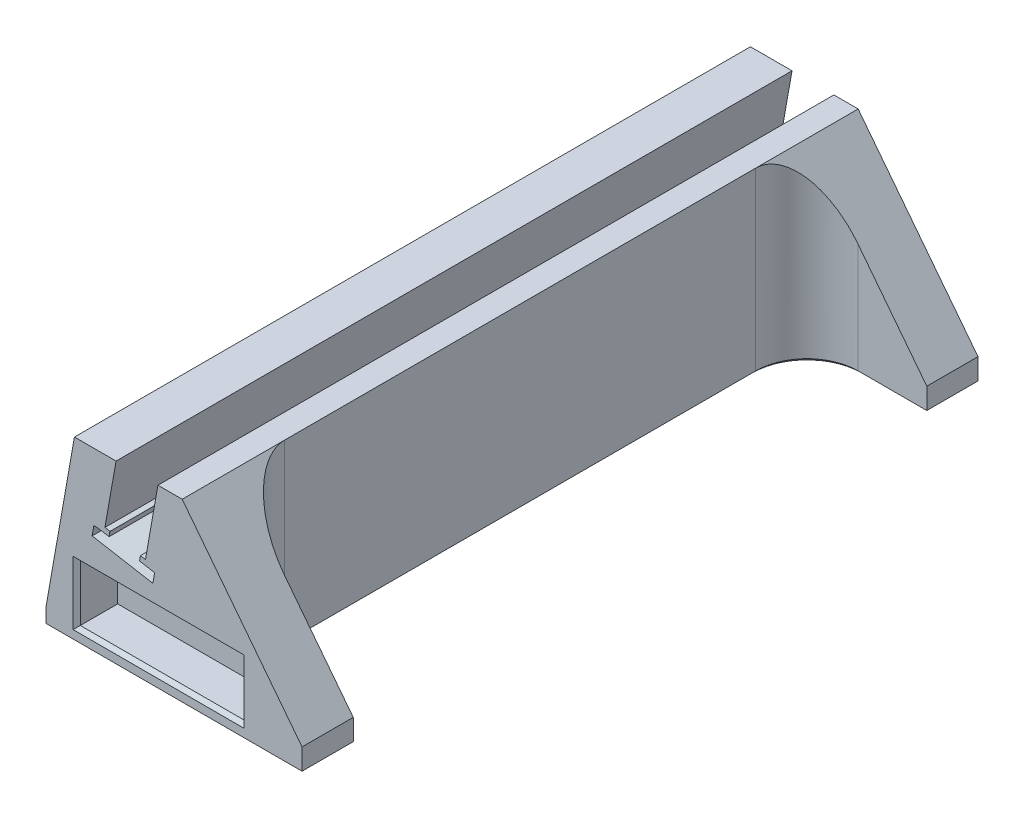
from build123d import *

# Parameters (mm, degrees)
AUFSATZ_LINEAR_AUSTRAGEN1_DEPTH = 132
SKIZZE2_W                       = 23.404053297
SKIZZE2_H                       = 112
SCHNITT_LINEAR_AUSTRAGEN1_DEPTH = 139.83083231
VERRUNDUNG1_R                   = 10
SKIZZE3_W                       = 32
SKIZZE3_H                       = 11
SCHNITT_LINEAR_AUSTRAGEN2_DEPTH = 8
LINEARES_MUSTER1_COUNT          = 2
LINEARES_MUSTER1_PITCH          = 124
SKIZZE4_W                       = 18.595946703
SKIZZE4_H                       = 110
SCHNITT_LINEAR_AUSTRAGEN3_DEPTH = 12
FASE1_SIZE                      = 0.7


with BuildPart() as part:
    # Skizze1 → Aufsatz-Linear austragen1 (new body)
    with BuildSketch(Plane.XY):
        Polygon((-19.443573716, 15), (-25, -16.512059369), (-25, -20), (25, -20), (25, -15.184189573), (1.595946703, 15), (-3.145976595, 15), (-5.577051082, 1.212691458), (-6.561858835, 1.386339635), (-6.735507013, 0.401531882), (-5.75069926, 0.227883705), (-3.781083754, -0.119412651), (-4.128380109, -2.089028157), (-15.995313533, 0.003432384), (-15.646551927, 1.972788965), (-13.665007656, 1.70171277), (-12.680199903, 1.528064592), (-12.506551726, 2.512872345), (-13.491359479, 2.686520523), (-11.32016082, 15), align=None)
    extrude(amount=AUFSATZ_LINEAR_AUSTRAGEN1_DEPTH)

    # Skizze2 → Schnitt-Linear austragen1 (cut, through all)
    with BuildSketch(Plane(origin=(0, 15, 0), x_dir=(1, 0, 0), z_dir=(0, 1, 0))):
        with Locations((13.297973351, -66)):
            Rectangle(SKIZZE2_W, SKIZZE2_H)
    extrude(amount=-SCHNITT_LINEAR_AUSTRAGEN1_DEPTH, mode=Mode.SUBTRACT)

    # Verrundung1
    verrundung1_edges = [part.edges().sort_by_distance(p)[0] for p in [
        (1.595946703, -2.5, 10),
        (1.595946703, -2.5, 122),
    ]]
    fillet(verrundung1_edges, radius=VERRUNDUNG1_R)

    # Skizze3 → Schnitt-Linear austragen2 (cut)
    with BuildSketch(Plane.XY.offset(132)):
        with Locations((-3, -11.5)):
            Rectangle(SKIZZE3_W, SKIZZE3_H)
    schnitt_linear_austragen2 = extrude(amount=-SCHNITT_LINEAR_AUSTRAGEN2_DEPTH, mode=Mode.SUBTRACT)

    # Lineares Muster1: Schnitt-Linear austragen2 ×2
    with Locations(*[(0, 0, -i * LINEARES_MUSTER1_PITCH) for i in range(1, LINEARES_MUSTER1_COUNT)]):
        add(schnitt_linear_austragen2, mode=Mode.SUBTRACT)

    # Skizze4 → Schnitt-Linear austragen3 (cut)
    with BuildSketch(Plane.XZ.offset(20)):
        with Locations((-11.702026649, 66)):
            Rectangle(SKIZZE4_W, SKIZZE4_H)
    extrude(amount=-SCHNITT_LINEAR_AUSTRAGEN3_DEPTH, mode=Mode.SUBTRACT)

    # Fase1
    fase1_edges = [part.edges().sort_by_distance(p)[0] for p in [
        (-19, -11.5, 132),
        (-3, -17, 132),
        (13, -11.5, 132),
        (-3, -6, 132),
        (-19, -11.5, 0),
        (-3, -6, 0),
        (13, -11.5, 0),
        (-3, -17, 0),
        (-21, -20, 66),
        (-11.702026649, -20, 11),
        (-2.404053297, -20, 66),
        (-11.702026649, -20, 121),
        (0, -20, 132),
        (0, -20, 0),
        (25, -20, 127),
        (-25, -20, 66),
        (25, -20, 5),
        (18.297973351, -20, 10),
        (18.297973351, -20, 122),
        (1.595946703, -20, 66),
        (4.524878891, -20, 119.071067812),
        (4.524878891, -20, 12.928932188),
    ]]
    chamfer(fase1_edges, length=FASE1_SIZE)


solid = part.part
